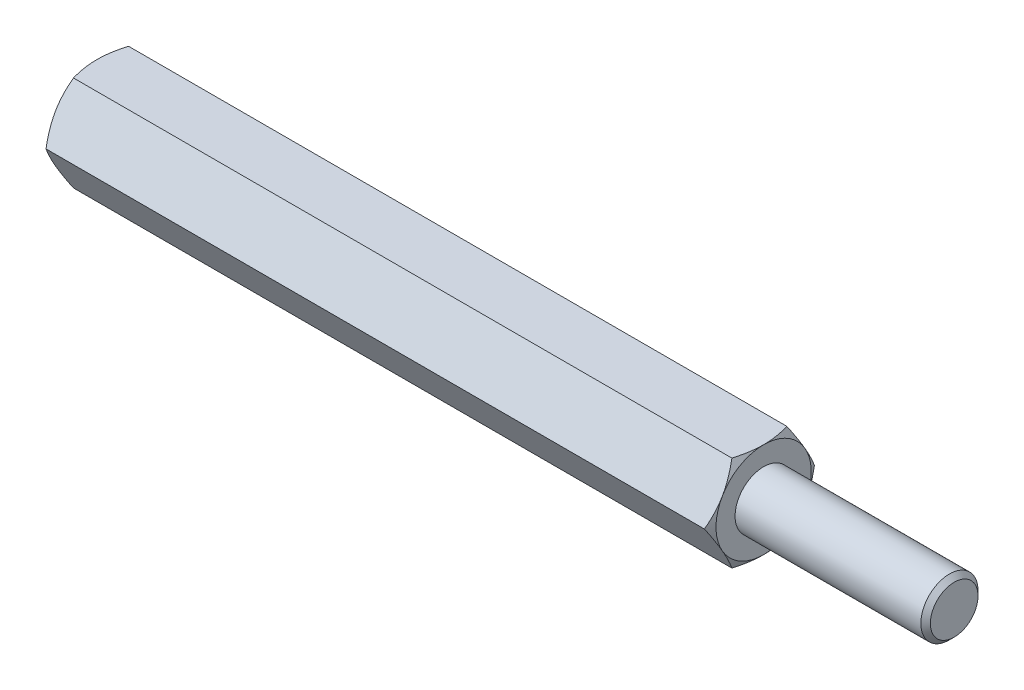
ISO-10303-21;
HEADER;
FILE_DESCRIPTION(('STEP AP214'),'2;1');
FILE_NAME('part.step','',(''),(''),'','','');
FILE_SCHEMA(('AUTOMOTIVE_DESIGN { 1 0 10303 214 1 1 1 1 }'));
ENDSEC;
DATA;
#1=APPLICATION_CONTEXT('core data for automotive mechanical design processes');
#2=APPLICATION_PROTOCOL_DEFINITION('international standard','automotive_design',2000,#1);
#3=PRODUCT_CONTEXT('',#1,'mechanical');
#4=PRODUCT('Part','Part','',(#3));
#5=PRODUCT_RELATED_PRODUCT_CATEGORY('part','',(#4));
#6=PRODUCT_DEFINITION_FORMATION('','',#4);
#7=PRODUCT_DEFINITION_CONTEXT('part definition',#1,'design');
#8=PRODUCT_DEFINITION('design','',#6,#7);
#9=PRODUCT_DEFINITION_SHAPE('','',#8);
#10=(LENGTH_UNIT() NAMED_UNIT(*) SI_UNIT(.MILLI.,.METRE.));
#11=(NAMED_UNIT(*) PLANE_ANGLE_UNIT() SI_UNIT($,.RADIAN.));
#12=(NAMED_UNIT(*) SI_UNIT($,.STERADIAN.) SOLID_ANGLE_UNIT());
#13=UNCERTAINTY_MEASURE_WITH_UNIT(LENGTH_MEASURE(1.E-05),#10,'distance_accuracy_value','');
#14=(GEOMETRIC_REPRESENTATION_CONTEXT(3) GLOBAL_UNCERTAINTY_ASSIGNED_CONTEXT((#13)) GLOBAL_UNIT_ASSIGNED_CONTEXT((#10,
#11,#12)) REPRESENTATION_CONTEXT('',''));
#15=CARTESIAN_POINT('',(0.,0.,0.));
#16=DIRECTION('',(0.,0.,1.));
#17=DIRECTION('',(1.,0.,0.));
#18=AXIS2_PLACEMENT_3D('',#15,#16,#17);
#19=CARTESIAN_POINT('',(17.5,2.5,-1.44337567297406));
#20=DIRECTION('',(1.,0.,0.));
#21=DIRECTION('',(0.,0.,-1.));
#22=AXIS2_PLACEMENT_3D('',#19,#20,#21);
#23=PLANE('',#22);
#24=CARTESIAN_POINT('',(17.5,0.,0.));
#25=DIRECTION('',(1.,0.,0.));
#26=DIRECTION('',(0.,0.,-1.));
#27=AXIS2_PLACEMENT_3D('',#24,#25,#26);
#28=CIRCLE('',#27,2.5);
#29=CARTESIAN_POINT('',(17.5,-1.25,-2.1650635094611));
#30=VERTEX_POINT('',#29);
#31=CARTESIAN_POINT('',(17.5,1.25,-2.1650635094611));
#32=VERTEX_POINT('',#31);
#33=EDGE_CURVE('E288',#30,#32,#28,.T.);
#34=ORIENTED_EDGE('',*,*,#33,.T.);
#35=CARTESIAN_POINT('',(17.5,2.5,0.));
#36=VERTEX_POINT('',#35);
#37=EDGE_CURVE('E53',#32,#36,#28,.T.);
#38=ORIENTED_EDGE('',*,*,#37,.T.);
#39=CARTESIAN_POINT('',(17.5,1.25,2.1650635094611));
#40=VERTEX_POINT('',#39);
#41=EDGE_CURVE('E297',#36,#40,#28,.T.);
#42=ORIENTED_EDGE('',*,*,#41,.T.);
#43=CARTESIAN_POINT('',(17.5,-1.25000000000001,2.1650635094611));
#44=VERTEX_POINT('',#43);
#45=EDGE_CURVE('E302',#40,#44,#28,.T.);
#46=ORIENTED_EDGE('',*,*,#45,.T.);
#47=CARTESIAN_POINT('',(17.5,0.,0.));
#48=DIRECTION('',(-1.,0.,0.));
#49=DIRECTION('',(0.,-1.,0.));
#50=AXIS2_PLACEMENT_3D('',#47,#48,#49);
#51=CIRCLE('',#50,2.5);
#52=CARTESIAN_POINT('',(17.5,-2.50000000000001,0.));
#53=VERTEX_POINT('',#52);
#54=EDGE_CURVE('E193',#53,#44,#51,.T.);
#55=ORIENTED_EDGE('',*,*,#54,.F.);
#56=EDGE_CURVE('E61',#53,#30,#28,.T.);
#57=ORIENTED_EDGE('',*,*,#56,.T.);
#58=EDGE_LOOP('',(#34,#38,#42,#46,#55,#57));
#59=FACE_BOUND('',#58,.T.);
#60=CARTESIAN_POINT('',(17.5,0.,0.));
#61=DIRECTION('',(1.,0.,0.));
#62=DIRECTION('',(0.,0.,-1.));
#63=AXIS2_PLACEMENT_3D('',#60,#61,#62);
#64=CIRCLE('',#63,1.5);
#65=CARTESIAN_POINT('',(17.5,0.,-1.5));
#66=VERTEX_POINT('',#65);
#67=EDGE_CURVE('E324',#66,#66,#64,.T.);
#68=ORIENTED_EDGE('',*,*,#67,.F.);
#69=EDGE_LOOP('',(#68));
#70=FACE_BOUND('',#69,.T.);
#71=ADVANCED_FACE('F37',(#59,#70),#23,.T.);
#72=CARTESIAN_POINT('',(17.5,0.,-2.88675134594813));
#73=DIRECTION('',(0.,-0.5,0.866025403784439));
#74=DIRECTION('',(0.,-0.866025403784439,-0.5));
#75=AXIS2_PLACEMENT_3D('',#72,#73,#74);
#76=PLANE('',#75);
#77=CARTESIAN_POINT('',(17.2766423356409,-0.000199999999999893,-2.88686681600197));
#78=CARTESIAN_POINT('',(17.3132783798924,0.109663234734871,-2.82343724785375));
#79=CARTESIAN_POINT('',(17.346597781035,0.220474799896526,-2.75946016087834));
#80=CARTESIAN_POINT('',(17.4047577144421,0.44401683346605,-2.63039810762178));
#81=CARTESIAN_POINT('',(17.4295776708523,0.556751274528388,-2.5653108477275));
#82=CARTESIAN_POINT('',(17.468214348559,0.780822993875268,-2.43594298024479));
#83=CARTESIAN_POINT('',(17.4822882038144,0.892125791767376,-2.37168227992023));
#84=CARTESIAN_POINT('',(17.4990908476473,1.11525522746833,-2.24285844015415));
#85=CARTESIAN_POINT('',(17.5018335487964,1.22708105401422,-2.17829576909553));
#86=CARTESIAN_POINT('',(17.4961342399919,1.43604197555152,-2.05765212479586));
#87=CARTESIAN_POINT('',(17.4890916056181,1.53320831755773,-2.0015531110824));
#88=CARTESIAN_POINT('',(17.4667685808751,1.726907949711,-1.88972057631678));
#89=CARTESIAN_POINT('',(17.4514805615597,1.82344056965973,-1.8339874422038));
#90=CARTESIAN_POINT('',(17.4132609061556,2.01753972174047,-1.7219242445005));
#91=CARTESIAN_POINT('',(17.3901672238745,2.11508168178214,-1.66560836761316));
#92=CARTESIAN_POINT('',(17.3377533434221,2.30871060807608,-1.55381665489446));
#93=CARTESIAN_POINT('',(17.3084454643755,2.40480005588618,-1.49833938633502));
#94=CARTESIAN_POINT('',(17.2766423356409,2.5002,-1.44326020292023));
#95=B_SPLINE_CURVE_WITH_KNOTS('',3,(#77,#78,#79,#80,#81,#82,#83,#84,#85,#86,#87,#88,#89,#90,#91,
#92,#93,#94),.UNSPECIFIED.,.F.,.F.,(4,2,2,2,2,2,2,2,4),(0.,0.396285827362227,0.79352433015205,
1.18093086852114,1.56786160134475,1.90479741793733,2.24204551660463,2.58677531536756,
2.93082800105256),.UNSPECIFIED.);
#96=CARTESIAN_POINT('',(17.2767090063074,0.,-2.88675134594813));
#97=VERTEX_POINT('',#96);
#98=EDGE_CURVE('E489',#97,#32,#95,.T.);
#99=ORIENTED_EDGE('',*,*,#98,.F.);
#100=DIRECTION('',(-1.,0.,0.));
#101=VECTOR('',#100,1.);
#102=CARTESIAN_POINT('',(17.5,0.,-2.88675134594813));
#103=LINE('',#102,#101);
#104=CARTESIAN_POINT('',(-17.2767090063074,0.,-2.88675134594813));
#105=VERTEX_POINT('',#104);
#106=EDGE_CURVE('E264',#97,#105,#103,.T.);
#107=ORIENTED_EDGE('',*,*,#106,.T.);
#108=CARTESIAN_POINT('',(-17.2766423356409,2.5002,-1.44326020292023));
#109=CARTESIAN_POINT('',(-17.3132783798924,2.39033676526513,-1.50668977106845));
#110=CARTESIAN_POINT('',(-17.346597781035,2.27952520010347,-1.57066685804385));
#111=CARTESIAN_POINT('',(-17.4047577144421,2.05598316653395,-1.69972891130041));
#112=CARTESIAN_POINT('',(-17.4295776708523,1.94324872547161,-1.7648161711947));
#113=CARTESIAN_POINT('',(-17.468214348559,1.71917700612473,-1.8941840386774));
#114=CARTESIAN_POINT('',(-17.4822882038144,1.60787420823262,-1.95844473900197));
#115=CARTESIAN_POINT('',(-17.4990908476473,1.38474477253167,-2.08726857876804));
#116=CARTESIAN_POINT('',(-17.5018335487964,1.27291894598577,-2.15183124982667));
#117=CARTESIAN_POINT('',(-17.4961342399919,1.06395802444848,-2.27247489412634));
#118=CARTESIAN_POINT('',(-17.4890916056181,0.966791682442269,-2.32857390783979));
#119=CARTESIAN_POINT('',(-17.4667685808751,0.773092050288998,-2.44040644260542));
#120=CARTESIAN_POINT('',(-17.4514805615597,0.676559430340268,-2.49613957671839));
#121=CARTESIAN_POINT('',(-17.4132609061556,0.482460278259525,-2.60820277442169));
#122=CARTESIAN_POINT('',(-17.3901672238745,0.38491831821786,-2.66451865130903));
#123=CARTESIAN_POINT('',(-17.3377533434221,0.191289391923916,-2.77631036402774));
#124=CARTESIAN_POINT('',(-17.3084454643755,0.0951999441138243,-2.83178763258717));
#125=CARTESIAN_POINT('',(-17.2766423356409,-0.000200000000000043,-2.88686681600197));
#126=B_SPLINE_CURVE_WITH_KNOTS('',3,(#108,#109,#110,#111,#112,#113,#114,#115,#116,#117,#118,
#119,#120,#121,#122,#123,#124,#125),.UNSPECIFIED.,.F.,.F.,(4,2,2,2,2,2,2,2,4),(0.,
0.396285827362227,0.793524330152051,1.18093086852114,1.56786160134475,1.90479741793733,
2.24204551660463,2.58677531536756,2.93082800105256),.UNSPECIFIED.);
#127=CARTESIAN_POINT('',(-17.5,1.25,-2.1650635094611));
#128=VERTEX_POINT('',#127);
#129=EDGE_CURVE('E507',#128,#105,#126,.T.);
#130=ORIENTED_EDGE('',*,*,#129,.F.);
#131=CARTESIAN_POINT('',(-17.2767090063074,2.5,-1.44337567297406));
#132=VERTEX_POINT('',#131);
#133=EDGE_CURVE('E505',#132,#128,#126,.T.);
#134=ORIENTED_EDGE('',*,*,#133,.F.);
#135=DIRECTION('',(-1.,0.,0.));
#136=VECTOR('',#135,1.);
#137=CARTESIAN_POINT('',(17.5,2.5,-1.44337567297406));
#138=LINE('',#137,#136);
#139=CARTESIAN_POINT('',(17.2767090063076,2.5,-1.44337567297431));
#140=VERTEX_POINT('',#139);
#141=EDGE_CURVE('E279',#140,#132,#138,.T.);
#142=ORIENTED_EDGE('',*,*,#141,.F.);
#143=EDGE_CURVE('E229',#32,#140,#95,.T.);
#144=ORIENTED_EDGE('',*,*,#143,.F.);
#145=EDGE_LOOP('',(#99,#107,#130,#134,#142,#144));
#146=FACE_BOUND('',#145,.T.);
#147=ADVANCED_FACE('F148',(#146),#76,.F.);
#148=CARTESIAN_POINT('',(17.5,2.5,-1.44337567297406));
#149=DIRECTION('',(0.,-1.,0.));
#150=DIRECTION('',(0.,0.,-1.));
#151=AXIS2_PLACEMENT_3D('',#148,#149,#150);
#152=PLANE('',#151);
#153=CARTESIAN_POINT('',(16.2680338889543,2.5,-3.90158441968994));
#154=CARTESIAN_POINT('',(16.3212077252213,2.5,-3.79217004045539));
#155=CARTESIAN_POINT('',(16.3738786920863,2.5,-3.68250707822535));
#156=CARTESIAN_POINT('',(16.4779324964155,2.5,-3.46255185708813));
#157=CARTESIAN_POINT('',(16.5293151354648,2.5,-3.35225950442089));
#158=CARTESIAN_POINT('',(16.6307630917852,2.5,-3.13035696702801));
#159=CARTESIAN_POINT('',(16.6808199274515,2.5,-3.0187428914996));
#160=CARTESIAN_POINT('',(16.7789171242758,2.5,-2.79463535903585));
#161=CARTESIAN_POINT('',(16.8269575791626,2.5,-2.68214194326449));
#162=CARTESIAN_POINT('',(16.9220184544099,2.5,-2.45240385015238));
#163=CARTESIAN_POINT('',(16.9689543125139,2.5,-2.33512399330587));
#164=CARTESIAN_POINT('',(17.0593326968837,2.5,-2.09920133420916));
#165=CARTESIAN_POINT('',(17.1027748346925,2.5,-1.98055838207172));
#166=CARTESIAN_POINT('',(17.1850435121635,2.5,-1.74193489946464));
#167=CARTESIAN_POINT('',(17.2238791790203,2.5,-1.6219575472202));
#168=CARTESIAN_POINT('',(17.2957050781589,2.5,-1.38028205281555));
#169=CARTESIAN_POINT('',(17.3286971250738,2.5,-1.25858445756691));
#170=CARTESIAN_POINT('',(17.3870959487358,2.5,-1.01406369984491));
#171=CARTESIAN_POINT('',(17.4125437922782,2.5,-0.891250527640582));
#172=CARTESIAN_POINT('',(17.4544275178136,2.5,-0.64407172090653));
#173=CARTESIAN_POINT('',(17.4708643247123,2.5,-0.519706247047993));
#174=CARTESIAN_POINT('',(17.4932006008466,2.5,-0.271679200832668));
#175=CARTESIAN_POINT('',(17.4992375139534,2.5,-0.148030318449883));
#176=CARTESIAN_POINT('',(17.5006256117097,2.5,0.0993395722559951));
#177=CARTESIAN_POINT('',(17.4959765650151,2.5,0.223060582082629));
#178=CARTESIAN_POINT('',(17.4794044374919,2.5,0.432351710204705));
#179=CARTESIAN_POINT('',(17.4701066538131,2.5,0.518143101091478));
#180=CARTESIAN_POINT('',(17.4469384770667,2.5,0.689112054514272));
#181=CARTESIAN_POINT('',(17.4330674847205,2.5,0.774289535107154));
#182=CARTESIAN_POINT('',(17.3853202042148,2.5,1.02876599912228));
#183=CARTESIAN_POINT('',(17.3453176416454,2.5,1.19691958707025));
#184=CARTESIAN_POINT('',(17.2522656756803,2.5,1.53362893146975));
#185=CARTESIAN_POINT('',(17.1989362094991,2.5,1.70210423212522));
#186=CARTESIAN_POINT('',(17.1123716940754,2.5,1.95247339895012));
#187=CARTESIAN_POINT('',(17.0824247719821,2.5,2.0355318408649));
#188=CARTESIAN_POINT('',(17.0206840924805,2.5,2.20095860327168));
#189=CARTESIAN_POINT('',(16.9888903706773,2.5,2.28332693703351));
#190=CARTESIAN_POINT('',(16.904014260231,2.5,2.49723312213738));
#191=CARTESIAN_POINT('',(16.8497173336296,2.5,2.62828796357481));
#192=CARTESIAN_POINT('',(16.7381273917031,2.5,2.88912034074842));
#193=CARTESIAN_POINT('',(16.6808341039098,2.5,3.01889775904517));
#194=CARTESIAN_POINT('',(16.5639348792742,2.5,3.27745045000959));
#195=CARTESIAN_POINT('',(16.504328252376,2.5,3.40622540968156));
#196=CARTESIAN_POINT('',(16.3833234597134,2.5,3.66293235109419));
#197=CARTESIAN_POINT('',(16.321925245,2.5,3.7908643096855));
#198=CARTESIAN_POINT('',(16.1354580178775,2.5,4.17399495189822));
#199=CARTESIAN_POINT('',(16.0082824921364,2.5,4.42816724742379));
#200=CARTESIAN_POINT('',(15.7503455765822,2.5,4.9346146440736));
#201=CARTESIAN_POINT('',(15.6195848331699,2.5,5.1868900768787));
#202=CARTESIAN_POINT('',(15.3687100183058,2.5,5.66512451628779));
#203=CARTESIAN_POINT('',(15.2488298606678,2.5,5.89120644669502));
#204=CARTESIAN_POINT('',(15.0075902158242,2.5,6.34259369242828));
#205=CARTESIAN_POINT('',(14.8862306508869,2.5,6.56789896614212));
#206=CARTESIAN_POINT('',(14.642780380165,2.5,7.01722044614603));
#207=CARTESIAN_POINT('',(14.5206930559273,2.5,7.24123848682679));
#208=CARTESIAN_POINT('',(14.2756662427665,2.5,7.68878772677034));
#209=CARTESIAN_POINT('',(14.152726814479,2.5,7.91231895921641));
#210=CARTESIAN_POINT('',(14.0294756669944,2.5,8.1356769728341));
#211=B_SPLINE_CURVE_WITH_KNOTS('',3,(#153,#154,#155,#156,#157,#158,#159,#160,#161,#162,#163,
#164,#165,#166,#167,#168,#169,#170,#171,#172,#173,#174,#175,#176,#177,#178,#179,#180,#181,#182,
#183,#184,#185,#186,#187,#188,#189,#190,#191,#192,#193,#194,#195,#196,#197,#198,#199,#200,#201,
#202,#203,#204,#205,#206,#207,#208,#209,#210),.UNSPECIFIED.,.F.,.F.,(4,2,2,2,2,2,2,2,2,2,2,2,2,
2,2,2,2,2,2,2,2,2,2,2,2,2,2,2,4),(0.,0.364957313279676,0.729970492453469,1.09692930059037,
1.46387103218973,1.84279746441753,2.22176597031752,2.59997058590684,2.97805755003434,
3.3540469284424,3.72999770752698,4.10094071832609,4.47189175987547,4.73064905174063,
4.98944026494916,5.50729076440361,6.037104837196,6.30196454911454,6.56681915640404,
6.99233818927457,7.41789598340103,7.84358170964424,8.26927907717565,9.12186602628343,
9.97430025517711,10.7419897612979,11.5097197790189,12.2750964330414,13.0404191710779),.UNSPECIFIED.);
#212=EDGE_CURVE('E227',#140,#36,#211,.T.);
#213=ORIENTED_EDGE('',*,*,#212,.F.);
#214=ORIENTED_EDGE('',*,*,#141,.T.);
#215=CARTESIAN_POINT('',(-16.2680338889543,2.5,-3.90158441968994));
#216=CARTESIAN_POINT('',(-16.3212077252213,2.5,-3.79217004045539));
#217=CARTESIAN_POINT('',(-16.3738786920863,2.5,-3.68250707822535));
#218=CARTESIAN_POINT('',(-16.4779324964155,2.5,-3.46255185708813));
#219=CARTESIAN_POINT('',(-16.5293151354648,2.5,-3.35225950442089));
#220=CARTESIAN_POINT('',(-16.6307630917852,2.5,-3.13035696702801));
#221=CARTESIAN_POINT('',(-16.6808199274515,2.5,-3.0187428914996));
#222=CARTESIAN_POINT('',(-16.7789171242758,2.5,-2.79463535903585));
#223=CARTESIAN_POINT('',(-16.8269575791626,2.5,-2.68214194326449));
#224=CARTESIAN_POINT('',(-16.9220184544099,2.5,-2.45240385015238));
#225=CARTESIAN_POINT('',(-16.9689543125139,2.5,-2.33512399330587));
#226=CARTESIAN_POINT('',(-17.0593326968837,2.5,-2.09920133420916));
#227=CARTESIAN_POINT('',(-17.1027748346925,2.5,-1.98055838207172));
#228=CARTESIAN_POINT('',(-17.1850435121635,2.5,-1.74193489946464));
#229=CARTESIAN_POINT('',(-17.2238791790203,2.5,-1.6219575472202));
#230=CARTESIAN_POINT('',(-17.2957050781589,2.5,-1.38028205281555));
#231=CARTESIAN_POINT('',(-17.3286971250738,2.5,-1.25858445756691));
#232=CARTESIAN_POINT('',(-17.3870959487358,2.5,-1.01406369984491));
#233=CARTESIAN_POINT('',(-17.4125437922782,2.5,-0.891250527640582));
#234=CARTESIAN_POINT('',(-17.4544275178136,2.5,-0.64407172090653));
#235=CARTESIAN_POINT('',(-17.4708643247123,2.5,-0.519706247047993));
#236=CARTESIAN_POINT('',(-17.4932006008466,2.5,-0.271679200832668));
#237=CARTESIAN_POINT('',(-17.4992375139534,2.5,-0.148030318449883));
#238=CARTESIAN_POINT('',(-17.5006256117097,2.5,0.0993395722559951));
#239=CARTESIAN_POINT('',(-17.4959765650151,2.5,0.223060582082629));
#240=CARTESIAN_POINT('',(-17.4794044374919,2.5,0.432351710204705));
#241=CARTESIAN_POINT('',(-17.4701066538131,2.5,0.518143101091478));
#242=CARTESIAN_POINT('',(-17.4469384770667,2.5,0.689112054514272));
#243=CARTESIAN_POINT('',(-17.4330674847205,2.5,0.774289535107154));
#244=CARTESIAN_POINT('',(-17.3853202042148,2.5,1.02876599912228));
#245=CARTESIAN_POINT('',(-17.3453176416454,2.5,1.19691958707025));
#246=CARTESIAN_POINT('',(-17.2522656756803,2.5,1.53362893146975));
#247=CARTESIAN_POINT('',(-17.1989362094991,2.5,1.70210423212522));
#248=CARTESIAN_POINT('',(-17.1123716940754,2.5,1.95247339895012));
#249=CARTESIAN_POINT('',(-17.0824247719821,2.5,2.0355318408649));
#250=CARTESIAN_POINT('',(-17.0206840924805,2.5,2.20095860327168));
#251=CARTESIAN_POINT('',(-16.9888903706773,2.5,2.28332693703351));
#252=CARTESIAN_POINT('',(-16.904014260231,2.5,2.49723312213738));
#253=CARTESIAN_POINT('',(-16.8497173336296,2.5,2.62828796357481));
#254=CARTESIAN_POINT('',(-16.7381273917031,2.5,2.88912034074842));
#255=CARTESIAN_POINT('',(-16.6808341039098,2.5,3.01889775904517));
#256=CARTESIAN_POINT('',(-16.5639348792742,2.5,3.27745045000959));
#257=CARTESIAN_POINT('',(-16.504328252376,2.5,3.40622540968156));
#258=CARTESIAN_POINT('',(-16.3833234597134,2.5,3.66293235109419));
#259=CARTESIAN_POINT('',(-16.321925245,2.5,3.7908643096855));
#260=CARTESIAN_POINT('',(-16.1354580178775,2.5,4.17399495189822));
#261=CARTESIAN_POINT('',(-16.0082824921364,2.5,4.42816724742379));
#262=CARTESIAN_POINT('',(-15.7503455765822,2.5,4.9346146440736));
#263=CARTESIAN_POINT('',(-15.6195848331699,2.5,5.1868900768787));
#264=CARTESIAN_POINT('',(-15.3687100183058,2.5,5.66512451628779));
#265=CARTESIAN_POINT('',(-15.2488298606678,2.5,5.89120644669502));
#266=CARTESIAN_POINT('',(-15.0075902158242,2.5,6.34259369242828));
#267=CARTESIAN_POINT('',(-14.8862306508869,2.5,6.56789896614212));
#268=CARTESIAN_POINT('',(-14.642780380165,2.5,7.01722044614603));
#269=CARTESIAN_POINT('',(-14.5206930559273,2.5,7.24123848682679));
#270=CARTESIAN_POINT('',(-14.2756662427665,2.5,7.68878772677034));
#271=CARTESIAN_POINT('',(-14.152726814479,2.5,7.91231895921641));
#272=CARTESIAN_POINT('',(-14.0294756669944,2.5,8.1356769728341));
#273=B_SPLINE_CURVE_WITH_KNOTS('',3,(#215,#216,#217,#218,#219,#220,#221,#222,#223,#224,#225,
#226,#227,#228,#229,#230,#231,#232,#233,#234,#235,#236,#237,#238,#239,#240,#241,#242,#243,#244,
#245,#246,#247,#248,#249,#250,#251,#252,#253,#254,#255,#256,#257,#258,#259,#260,#261,#262,#263,
#264,#265,#266,#267,#268,#269,#270,#271,#272),.UNSPECIFIED.,.F.,.F.,(4,2,2,2,2,2,2,2,2,2,2,2,2,
2,2,2,2,2,2,2,2,2,2,2,2,2,2,2,4),(0.,0.364957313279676,0.729970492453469,1.09692930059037,
1.46387103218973,1.84279746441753,2.22176597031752,2.59997058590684,2.97805755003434,
3.3540469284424,3.72999770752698,4.10094071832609,4.47189175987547,4.73064905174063,
4.98944026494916,5.50729076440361,6.037104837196,6.30196454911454,6.56681915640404,
6.99233818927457,7.41789598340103,7.84358170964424,8.26927907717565,9.12186602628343,
9.97430025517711,10.7419897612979,11.5097197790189,12.2750964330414,13.0404191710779),.UNSPECIFIED.);
#274=CARTESIAN_POINT('',(-17.5,2.5,0.));
#275=VERTEX_POINT('',#274);
#276=EDGE_CURVE('E241',#275,#132,#273,.F.);
#277=ORIENTED_EDGE('',*,*,#276,.F.);
#278=CARTESIAN_POINT('',(-17.2767090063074,2.5,1.44337567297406));
#279=VERTEX_POINT('',#278);
#280=EDGE_CURVE('E249',#279,#275,#273,.F.);
#281=ORIENTED_EDGE('',*,*,#280,.F.);
#282=DIRECTION('',(-1.,0.,0.));
#283=VECTOR('',#282,1.);
#284=CARTESIAN_POINT('',(17.5,2.5,1.44337567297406));
#285=LINE('',#284,#283);
#286=CARTESIAN_POINT('',(17.2767090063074,2.5,1.44337567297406));
#287=VERTEX_POINT('',#286);
#288=EDGE_CURVE('E276',#287,#279,#285,.T.);
#289=ORIENTED_EDGE('',*,*,#288,.F.);
#290=EDGE_CURVE('E221',#36,#287,#211,.T.);
#291=ORIENTED_EDGE('',*,*,#290,.F.);
#292=EDGE_LOOP('',(#213,#214,#277,#281,#289,#291));
#293=FACE_BOUND('',#292,.T.);
#294=ADVANCED_FACE('F153',(#293),#152,.F.);
#295=CARTESIAN_POINT('',(17.5,2.5,1.44337567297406));
#296=DIRECTION('',(0.,-0.5,-0.866025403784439));
#297=DIRECTION('',(0.,0.866025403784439,-0.5));
#298=AXIS2_PLACEMENT_3D('',#295,#296,#297);
#299=PLANE('',#298);
#300=CARTESIAN_POINT('',(17.2766423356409,2.5002,1.44326020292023));
#301=CARTESIAN_POINT('',(17.3132783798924,2.39033676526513,1.50668977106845));
#302=CARTESIAN_POINT('',(17.3465977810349,2.27952520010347,1.57066685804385));
#303=CARTESIAN_POINT('',(17.4047577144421,2.05598316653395,1.69972891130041));
#304=CARTESIAN_POINT('',(17.4295776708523,1.94324872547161,1.7648161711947));
#305=CARTESIAN_POINT('',(17.468214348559,1.71917700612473,1.8941840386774));
#306=CARTESIAN_POINT('',(17.4822882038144,1.60787420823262,1.95844473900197));
#307=CARTESIAN_POINT('',(17.4990908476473,1.38474477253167,2.08726857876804));
#308=CARTESIAN_POINT('',(17.5018335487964,1.27291894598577,2.15183124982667));
#309=CARTESIAN_POINT('',(17.4961342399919,1.06395802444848,2.27247489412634));
#310=CARTESIAN_POINT('',(17.4890916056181,0.96679168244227,2.32857390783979));
#311=CARTESIAN_POINT('',(17.4667685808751,0.773092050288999,2.44040644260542));
#312=CARTESIAN_POINT('',(17.4514805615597,0.676559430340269,2.49613957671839));
#313=CARTESIAN_POINT('',(17.4132609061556,0.482460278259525,2.60820277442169));
#314=CARTESIAN_POINT('',(17.3901672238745,0.384918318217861,2.66451865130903));
#315=CARTESIAN_POINT('',(17.3377533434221,0.191289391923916,2.77631036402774));
#316=CARTESIAN_POINT('',(17.3084454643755,0.0951999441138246,2.83178763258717));
#317=CARTESIAN_POINT('',(17.2766423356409,-0.000199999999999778,2.88686681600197));
#318=B_SPLINE_CURVE_WITH_KNOTS('',3,(#300,#301,#302,#303,#304,#305,#306,#307,#308,#309,#310,
#311,#312,#313,#314,#315,#316,#317),.UNSPECIFIED.,.F.,.F.,(4,2,2,2,2,2,2,2,4),(0.,
0.396285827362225,0.793524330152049,1.18093086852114,1.56786160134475,1.90479741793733,
2.24204551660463,2.58677531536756,2.93082800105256),.UNSPECIFIED.);
#319=EDGE_CURVE('E228',#287,#40,#318,.T.);
#320=ORIENTED_EDGE('',*,*,#319,.F.);
#321=ORIENTED_EDGE('',*,*,#288,.T.);
#322=CARTESIAN_POINT('',(-17.2766423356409,-0.000199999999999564,2.88686681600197));
#323=CARTESIAN_POINT('',(-17.3132783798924,0.109663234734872,2.82343724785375));
#324=CARTESIAN_POINT('',(-17.346597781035,0.220474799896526,2.75946016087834));
#325=CARTESIAN_POINT('',(-17.4047577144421,0.44401683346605,2.63039810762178));
#326=CARTESIAN_POINT('',(-17.4295776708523,0.556751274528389,2.5653108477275));
#327=CARTESIAN_POINT('',(-17.468214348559,0.780822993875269,2.43594298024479));
#328=CARTESIAN_POINT('',(-17.4822882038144,0.892125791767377,2.37168227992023));
#329=CARTESIAN_POINT('',(-17.4990908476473,1.11525522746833,2.24285844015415));
#330=CARTESIAN_POINT('',(-17.5018335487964,1.22708105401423,2.17829576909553));
#331=CARTESIAN_POINT('',(-17.4961342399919,1.43604197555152,2.05765212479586));
#332=CARTESIAN_POINT('',(-17.4890916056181,1.53320831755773,2.0015531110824));
#333=CARTESIAN_POINT('',(-17.4667685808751,1.726907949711,1.88972057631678));
#334=CARTESIAN_POINT('',(-17.4514805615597,1.82344056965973,1.8339874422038));
#335=CARTESIAN_POINT('',(-17.4132609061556,2.01753972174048,1.7219242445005));
#336=CARTESIAN_POINT('',(-17.3901672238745,2.11508168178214,1.66560836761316));
#337=CARTESIAN_POINT('',(-17.3377533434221,2.30871060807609,1.55381665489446));
#338=CARTESIAN_POINT('',(-17.3084454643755,2.40480005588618,1.49833938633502));
#339=CARTESIAN_POINT('',(-17.2766423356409,2.5002,1.44326020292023));
#340=B_SPLINE_CURVE_WITH_KNOTS('',3,(#322,#323,#324,#325,#326,#327,#328,#329,#330,#331,#332,
#333,#334,#335,#336,#337,#338,#339),.UNSPECIFIED.,.F.,.F.,(4,2,2,2,2,2,2,2,4),(0.,
0.396285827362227,0.793524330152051,1.18093086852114,1.56786160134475,1.90479741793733,
2.24204551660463,2.58677531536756,2.93082800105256),.UNSPECIFIED.);
#341=CARTESIAN_POINT('',(-17.5,1.25,2.1650635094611));
#342=VERTEX_POINT('',#341);
#343=EDGE_CURVE('E255',#342,#279,#340,.T.);
#344=ORIENTED_EDGE('',*,*,#343,.F.);
#345=CARTESIAN_POINT('',(-17.2767090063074,0.,2.88675134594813));
#346=VERTEX_POINT('',#345);
#347=EDGE_CURVE('E262',#346,#342,#340,.T.);
#348=ORIENTED_EDGE('',*,*,#347,.F.);
#349=DIRECTION('',(-1.,0.,0.));
#350=VECTOR('',#349,1.);
#351=CARTESIAN_POINT('',(17.5,0.,2.88675134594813));
#352=LINE('',#351,#350);
#353=CARTESIAN_POINT('',(17.2767090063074,0.,2.88675134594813));
#354=VERTEX_POINT('',#353);
#355=EDGE_CURVE('E273',#354,#346,#352,.T.);
#356=ORIENTED_EDGE('',*,*,#355,.F.);
#357=EDGE_CURVE('E215',#40,#354,#318,.T.);
#358=ORIENTED_EDGE('',*,*,#357,.F.);
#359=EDGE_LOOP('',(#320,#321,#344,#348,#356,#358));
#360=FACE_BOUND('',#359,.T.);
#361=ADVANCED_FACE('F235',(#360),#299,.F.);
#362=CARTESIAN_POINT('',(17.5,0.,2.88675134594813));
#363=DIRECTION('',(0.,0.5,-0.866025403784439));
#364=DIRECTION('',(0.,0.866025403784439,0.5));
#365=AXIS2_PLACEMENT_3D('',#362,#363,#364);
#366=PLANE('',#365);
#367=CARTESIAN_POINT('',(17.2766423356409,0.000200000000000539,2.88686681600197));
#368=CARTESIAN_POINT('',(17.3132783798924,-0.109663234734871,2.82343724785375));
#369=CARTESIAN_POINT('',(17.346597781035,-0.220474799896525,2.75946016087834));
#370=CARTESIAN_POINT('',(17.4047577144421,-0.444016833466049,2.63039810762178));
#371=CARTESIAN_POINT('',(17.4295776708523,-0.556751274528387,2.5653108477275));
#372=CARTESIAN_POINT('',(17.468214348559,-0.780822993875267,2.43594298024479));
#373=CARTESIAN_POINT('',(17.4822882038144,-0.892125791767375,2.37168227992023));
#374=CARTESIAN_POINT('',(17.4990908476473,-1.11525522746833,2.24285844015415));
#375=CARTESIAN_POINT('',(17.5018335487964,-1.22708105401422,2.17829576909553));
#376=CARTESIAN_POINT('',(17.4961342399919,-1.43604197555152,2.05765212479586));
#377=CARTESIAN_POINT('',(17.4890916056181,-1.53320831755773,2.0015531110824));
#378=CARTESIAN_POINT('',(17.4667685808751,-1.726907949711,1.88972057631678));
#379=CARTESIAN_POINT('',(17.4514805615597,-1.82344056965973,1.8339874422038));
#380=CARTESIAN_POINT('',(17.4132609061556,-2.01753972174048,1.7219242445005));
#381=CARTESIAN_POINT('',(17.3901672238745,-2.11508168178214,1.66560836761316));
#382=CARTESIAN_POINT('',(17.3377533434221,-2.30871060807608,1.55381665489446));
#383=CARTESIAN_POINT('',(17.3084454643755,-2.40480005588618,1.49833938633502));
#384=CARTESIAN_POINT('',(17.2766423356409,-2.5002,1.44326020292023));
#385=B_SPLINE_CURVE_WITH_KNOTS('',3,(#367,#368,#369,#370,#371,#372,#373,#374,#375,#376,#377,
#378,#379,#380,#381,#382,#383,#384),.UNSPECIFIED.,.F.,.F.,(4,2,2,2,2,2,2,2,4),(0.,
0.396285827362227,0.793524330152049,1.18093086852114,1.56786160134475,1.90479741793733,
2.24204551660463,2.58677531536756,2.93082800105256),.UNSPECIFIED.);
#386=EDGE_CURVE('E341',#354,#44,#385,.T.);
#387=ORIENTED_EDGE('',*,*,#386,.F.);
#388=ORIENTED_EDGE('',*,*,#355,.T.);
#389=CARTESIAN_POINT('',(-17.2766423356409,-2.5002,1.44326020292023));
#390=CARTESIAN_POINT('',(-17.3132783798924,-2.39033676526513,1.50668977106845));
#391=CARTESIAN_POINT('',(-17.346597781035,-2.27952520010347,1.57066685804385));
#392=CARTESIAN_POINT('',(-17.4047577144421,-2.05598316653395,1.69972891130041));
#393=CARTESIAN_POINT('',(-17.4295776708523,-1.94324872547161,1.7648161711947));
#394=CARTESIAN_POINT('',(-17.468214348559,-1.71917700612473,1.8941840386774));
#395=CARTESIAN_POINT('',(-17.4822882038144,-1.60787420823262,1.95844473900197));
#396=CARTESIAN_POINT('',(-17.4990908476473,-1.38474477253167,2.08726857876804));
#397=CARTESIAN_POINT('',(-17.5018335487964,-1.27291894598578,2.15183124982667));
#398=CARTESIAN_POINT('',(-17.4961342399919,-1.06395802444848,2.27247489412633));
#399=CARTESIAN_POINT('',(-17.4890916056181,-0.966791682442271,2.32857390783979));
#400=CARTESIAN_POINT('',(-17.4667685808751,-0.773092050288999,2.44040644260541));
#401=CARTESIAN_POINT('',(-17.4514805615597,-0.676559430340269,2.49613957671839));
#402=CARTESIAN_POINT('',(-17.4132609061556,-0.482460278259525,2.60820277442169));
#403=CARTESIAN_POINT('',(-17.3901672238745,-0.384918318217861,2.66451865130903));
#404=CARTESIAN_POINT('',(-17.3377533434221,-0.191289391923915,2.77631036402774));
#405=CARTESIAN_POINT('',(-17.3084454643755,-0.0951999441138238,2.83178763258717));
#406=CARTESIAN_POINT('',(-17.2766423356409,0.00020000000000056,2.88686681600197));
#407=B_SPLINE_CURVE_WITH_KNOTS('',3,(#389,#390,#391,#392,#393,#394,#395,#396,#397,#398,#399,
#400,#401,#402,#403,#404,#405,#406),.UNSPECIFIED.,.F.,.F.,(4,2,2,2,2,2,2,2,4),(0.,
0.396285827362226,0.793524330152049,1.18093086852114,1.56786160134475,1.90479741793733,
2.24204551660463,2.58677531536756,2.93082800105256),.UNSPECIFIED.);
#408=CARTESIAN_POINT('',(-17.5,-1.25000000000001,2.1650635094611));
#409=VERTEX_POINT('',#408);
#410=EDGE_CURVE('E263',#409,#346,#407,.T.);
#411=ORIENTED_EDGE('',*,*,#410,.F.);
#412=CARTESIAN_POINT('',(-17.2767090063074,-2.5,1.44337567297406));
#413=VERTEX_POINT('',#412);
#414=EDGE_CURVE('E250',#413,#409,#407,.T.);
#415=ORIENTED_EDGE('',*,*,#414,.F.);
#416=DIRECTION('',(-1.,0.,0.));
#417=VECTOR('',#416,1.);
#418=CARTESIAN_POINT('',(17.5,-2.5,1.44337567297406));
#419=LINE('',#418,#417);
#420=CARTESIAN_POINT('',(17.2767090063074,-2.5,1.44337567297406));
#421=VERTEX_POINT('',#420);
#422=EDGE_CURVE('E270',#421,#413,#419,.T.);
#423=ORIENTED_EDGE('',*,*,#422,.F.);
#424=EDGE_CURVE('E210',#44,#421,#385,.T.);
#425=ORIENTED_EDGE('',*,*,#424,.F.);
#426=EDGE_LOOP('',(#387,#388,#411,#415,#423,#425));
#427=FACE_BOUND('',#426,.T.);
#428=ADVANCED_FACE('F411',(#427),#366,.F.);
#429=CARTESIAN_POINT('',(17.5,-2.5,1.44337567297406));
#430=DIRECTION('',(0.,1.,0.));
#431=DIRECTION('',(0.,0.,1.));
#432=AXIS2_PLACEMENT_3D('',#429,#430,#431);
#433=PLANE('',#432);
#434=CARTESIAN_POINT('',(16.2680338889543,-2.5,-3.90158441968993));
#435=CARTESIAN_POINT('',(16.3212077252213,-2.5,-3.79217004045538));
#436=CARTESIAN_POINT('',(16.3738786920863,-2.5,-3.68250707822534));
#437=CARTESIAN_POINT('',(16.4779324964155,-2.5,-3.46255185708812));
#438=CARTESIAN_POINT('',(16.5293151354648,-2.5,-3.35225950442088));
#439=CARTESIAN_POINT('',(16.6307630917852,-2.5,-3.130356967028));
#440=CARTESIAN_POINT('',(16.6808199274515,-2.5,-3.01874289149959));
#441=CARTESIAN_POINT('',(16.7789171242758,-2.5,-2.79463535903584));
#442=CARTESIAN_POINT('',(16.8269575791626,-2.5,-2.68214194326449));
#443=CARTESIAN_POINT('',(16.9220184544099,-2.5,-2.45240385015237));
#444=CARTESIAN_POINT('',(16.9689543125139,-2.5,-2.33512399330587));
#445=CARTESIAN_POINT('',(17.0593326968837,-2.5,-2.09920133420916));
#446=CARTESIAN_POINT('',(17.1027748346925,-2.5,-1.98055838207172));
#447=CARTESIAN_POINT('',(17.1850435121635,-2.5,-1.74193489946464));
#448=CARTESIAN_POINT('',(17.2238791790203,-2.5,-1.6219575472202));
#449=CARTESIAN_POINT('',(17.2957050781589,-2.5,-1.38028205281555));
#450=CARTESIAN_POINT('',(17.3286971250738,-2.5,-1.25858445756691));
#451=CARTESIAN_POINT('',(17.3870959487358,-2.5,-1.01406369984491));
#452=CARTESIAN_POINT('',(17.4125437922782,-2.5,-0.891250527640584));
#453=CARTESIAN_POINT('',(17.4544275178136,-2.5,-0.644071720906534));
#454=CARTESIAN_POINT('',(17.4708643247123,-2.5,-0.519706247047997));
#455=CARTESIAN_POINT('',(17.4932006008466,-2.5,-0.271679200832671));
#456=CARTESIAN_POINT('',(17.4992375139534,-2.5,-0.148030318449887));
#457=CARTESIAN_POINT('',(17.5006256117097,-2.5,0.09933957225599));
#458=CARTESIAN_POINT('',(17.4959765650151,-2.5,0.223060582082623));
#459=CARTESIAN_POINT('',(17.479404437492,-2.5,0.432351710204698));
#460=CARTESIAN_POINT('',(17.4701066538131,-2.5,0.518143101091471));
#461=CARTESIAN_POINT('',(17.4469384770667,-2.5,0.689112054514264));
#462=CARTESIAN_POINT('',(17.4330674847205,-2.5,0.774289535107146));
#463=CARTESIAN_POINT('',(17.3853202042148,-2.5,1.02876599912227));
#464=CARTESIAN_POINT('',(17.3453176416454,-2.5,1.19691958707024));
#465=CARTESIAN_POINT('',(17.2522656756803,-2.5,1.53362893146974));
#466=CARTESIAN_POINT('',(17.1989362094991,-2.5,1.70210423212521));
#467=CARTESIAN_POINT('',(17.1123716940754,-2.5,1.95247339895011));
#468=CARTESIAN_POINT('',(17.0824247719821,-2.5,2.03553184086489));
#469=CARTESIAN_POINT('',(17.0206840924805,-2.5,2.20095860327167));
#470=CARTESIAN_POINT('',(16.9888903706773,-2.5,2.2833269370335));
#471=CARTESIAN_POINT('',(16.904014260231,-2.5,2.49723312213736));
#472=CARTESIAN_POINT('',(16.8497173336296,-2.5,2.6282879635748));
#473=CARTESIAN_POINT('',(16.7381273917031,-2.5,2.88912034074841));
#474=CARTESIAN_POINT('',(16.6808341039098,-2.5,3.01889775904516));
#475=CARTESIAN_POINT('',(16.5639348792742,-2.5,3.27745045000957));
#476=CARTESIAN_POINT('',(16.504328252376,-2.5,3.40622540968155));
#477=CARTESIAN_POINT('',(16.3833234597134,-2.5,3.66293235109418));
#478=CARTESIAN_POINT('',(16.321925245,-2.5,3.79086430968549));
#479=CARTESIAN_POINT('',(16.1354580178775,-2.5,4.17399495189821));
#480=CARTESIAN_POINT('',(16.0082824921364,-2.5,4.42816724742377));
#481=CARTESIAN_POINT('',(15.7503455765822,-2.5,4.93461464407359));
#482=CARTESIAN_POINT('',(15.6195848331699,-2.5,5.18689007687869));
#483=CARTESIAN_POINT('',(15.3687100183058,-2.5,5.66512451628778));
#484=CARTESIAN_POINT('',(15.2488298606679,-2.5,5.89120644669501));
#485=CARTESIAN_POINT('',(15.0075902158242,-2.5,6.34259369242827));
#486=CARTESIAN_POINT('',(14.8862306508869,-2.5,6.56789896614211));
#487=CARTESIAN_POINT('',(14.642780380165,-2.5,7.01722044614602));
#488=CARTESIAN_POINT('',(14.5206930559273,-2.5,7.24123848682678));
#489=CARTESIAN_POINT('',(14.2756662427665,-2.5,7.68878772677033));
#490=CARTESIAN_POINT('',(14.152726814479,-2.5,7.9123189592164));
#491=CARTESIAN_POINT('',(14.0294756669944,-2.5,8.13567697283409));
#492=B_SPLINE_CURVE_WITH_KNOTS('',3,(#434,#435,#436,#437,#438,#439,#440,#441,#442,#443,#444,
#445,#446,#447,#448,#449,#450,#451,#452,#453,#454,#455,#456,#457,#458,#459,#460,#461,#462,#463,
#464,#465,#466,#467,#468,#469,#470,#471,#472,#473,#474,#475,#476,#477,#478,#479,#480,#481,#482,
#483,#484,#485,#486,#487,#488,#489,#490,#491),.UNSPECIFIED.,.F.,.F.,(4,2,2,2,2,2,2,2,2,2,2,2,2,
2,2,2,2,2,2,2,2,2,2,2,2,2,2,2,4),(0.,0.364957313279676,0.729970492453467,1.09692930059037,
1.46387103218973,1.84279746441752,2.22176597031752,2.59997058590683,2.97805755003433,
3.35404692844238,3.72999770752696,4.10094071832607,4.47189175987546,4.73064905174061,
4.98944026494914,5.50729076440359,6.03710483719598,6.30196454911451,6.56681915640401,
6.99233818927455,7.417895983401,7.84358170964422,8.26927907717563,9.12186602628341,
9.97430025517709,10.7419897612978,11.5097197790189,12.2750964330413,13.0404191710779),.UNSPECIFIED.);
#493=EDGE_CURVE('E334',#421,#53,#492,.F.);
#494=ORIENTED_EDGE('',*,*,#493,.F.);
#495=ORIENTED_EDGE('',*,*,#422,.T.);
#496=CARTESIAN_POINT('',(-16.2680338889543,-2.5,-3.90158441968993));
#497=CARTESIAN_POINT('',(-16.3212077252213,-2.5,-3.79217004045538));
#498=CARTESIAN_POINT('',(-16.3738786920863,-2.5,-3.68250707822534));
#499=CARTESIAN_POINT('',(-16.4779324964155,-2.5,-3.46255185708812));
#500=CARTESIAN_POINT('',(-16.5293151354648,-2.5,-3.35225950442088));
#501=CARTESIAN_POINT('',(-16.6307630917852,-2.5,-3.130356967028));
#502=CARTESIAN_POINT('',(-16.6808199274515,-2.5,-3.01874289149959));
#503=CARTESIAN_POINT('',(-16.7789171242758,-2.5,-2.79463535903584));
#504=CARTESIAN_POINT('',(-16.8269575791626,-2.5,-2.68214194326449));
#505=CARTESIAN_POINT('',(-16.9220184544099,-2.5,-2.45240385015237));
#506=CARTESIAN_POINT('',(-16.9689543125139,-2.5,-2.33512399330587));
#507=CARTESIAN_POINT('',(-17.0593326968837,-2.5,-2.09920133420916));
#508=CARTESIAN_POINT('',(-17.1027748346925,-2.5,-1.98055838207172));
#509=CARTESIAN_POINT('',(-17.1850435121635,-2.5,-1.74193489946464));
#510=CARTESIAN_POINT('',(-17.2238791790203,-2.5,-1.6219575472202));
#511=CARTESIAN_POINT('',(-17.2957050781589,-2.5,-1.38028205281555));
#512=CARTESIAN_POINT('',(-17.3286971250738,-2.5,-1.25858445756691));
#513=CARTESIAN_POINT('',(-17.3870959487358,-2.5,-1.01406369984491));
#514=CARTESIAN_POINT('',(-17.4125437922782,-2.5,-0.891250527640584));
#515=CARTESIAN_POINT('',(-17.4544275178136,-2.5,-0.644071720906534));
#516=CARTESIAN_POINT('',(-17.4708643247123,-2.5,-0.519706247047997));
#517=CARTESIAN_POINT('',(-17.4932006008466,-2.5,-0.271679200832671));
#518=CARTESIAN_POINT('',(-17.4992375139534,-2.5,-0.148030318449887));
#519=CARTESIAN_POINT('',(-17.5006256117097,-2.5,0.09933957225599));
#520=CARTESIAN_POINT('',(-17.4959765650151,-2.5,0.223060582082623));
#521=CARTESIAN_POINT('',(-17.479404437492,-2.5,0.432351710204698));
#522=CARTESIAN_POINT('',(-17.4701066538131,-2.5,0.518143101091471));
#523=CARTESIAN_POINT('',(-17.4469384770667,-2.5,0.689112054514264));
#524=CARTESIAN_POINT('',(-17.4330674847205,-2.5,0.774289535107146));
#525=CARTESIAN_POINT('',(-17.3853202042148,-2.5,1.02876599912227));
#526=CARTESIAN_POINT('',(-17.3453176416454,-2.5,1.19691958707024));
#527=CARTESIAN_POINT('',(-17.2522656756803,-2.5,1.53362893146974));
#528=CARTESIAN_POINT('',(-17.1989362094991,-2.5,1.70210423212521));
#529=CARTESIAN_POINT('',(-17.1123716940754,-2.5,1.95247339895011));
#530=CARTESIAN_POINT('',(-17.0824247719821,-2.5,2.03553184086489));
#531=CARTESIAN_POINT('',(-17.0206840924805,-2.5,2.20095860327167));
#532=CARTESIAN_POINT('',(-16.9888903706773,-2.5,2.2833269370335));
#533=CARTESIAN_POINT('',(-16.904014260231,-2.5,2.49723312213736));
#534=CARTESIAN_POINT('',(-16.8497173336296,-2.5,2.6282879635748));
#535=CARTESIAN_POINT('',(-16.7381273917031,-2.5,2.88912034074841));
#536=CARTESIAN_POINT('',(-16.6808341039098,-2.5,3.01889775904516));
#537=CARTESIAN_POINT('',(-16.5639348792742,-2.5,3.27745045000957));
#538=CARTESIAN_POINT('',(-16.504328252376,-2.5,3.40622540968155));
#539=CARTESIAN_POINT('',(-16.3833234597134,-2.5,3.66293235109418));
#540=CARTESIAN_POINT('',(-16.321925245,-2.5,3.79086430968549));
#541=CARTESIAN_POINT('',(-16.1354580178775,-2.5,4.17399495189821));
#542=CARTESIAN_POINT('',(-16.0082824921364,-2.5,4.42816724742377));
#543=CARTESIAN_POINT('',(-15.7503455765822,-2.5,4.93461464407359));
#544=CARTESIAN_POINT('',(-15.6195848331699,-2.5,5.18689007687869));
#545=CARTESIAN_POINT('',(-15.3687100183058,-2.5,5.66512451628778));
#546=CARTESIAN_POINT('',(-15.2488298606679,-2.5,5.89120644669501));
#547=CARTESIAN_POINT('',(-15.0075902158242,-2.5,6.34259369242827));
#548=CARTESIAN_POINT('',(-14.8862306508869,-2.5,6.56789896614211));
#549=CARTESIAN_POINT('',(-14.642780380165,-2.5,7.01722044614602));
#550=CARTESIAN_POINT('',(-14.5206930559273,-2.5,7.24123848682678));
#551=CARTESIAN_POINT('',(-14.2756662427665,-2.5,7.68878772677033));
#552=CARTESIAN_POINT('',(-14.152726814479,-2.5,7.9123189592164));
#553=CARTESIAN_POINT('',(-14.0294756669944,-2.5,8.13567697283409));
#554=B_SPLINE_CURVE_WITH_KNOTS('',3,(#496,#497,#498,#499,#500,#501,#502,#503,#504,#505,#506,
#507,#508,#509,#510,#511,#512,#513,#514,#515,#516,#517,#518,#519,#520,#521,#522,#523,#524,#525,
#526,#527,#528,#529,#530,#531,#532,#533,#534,#535,#536,#537,#538,#539,#540,#541,#542,#543,#544,
#545,#546,#547,#548,#549,#550,#551,#552,#553),.UNSPECIFIED.,.F.,.F.,(4,2,2,2,2,2,2,2,2,2,2,2,2,
2,2,2,2,2,2,2,2,2,2,2,2,2,2,2,4),(0.,0.364957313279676,0.729970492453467,1.09692930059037,
1.46387103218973,1.84279746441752,2.22176597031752,2.59997058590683,2.97805755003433,
3.35404692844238,3.72999770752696,4.10094071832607,4.47189175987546,4.73064905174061,
4.98944026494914,5.50729076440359,6.03710483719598,6.30196454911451,6.56681915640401,
6.99233818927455,7.417895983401,7.84358170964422,8.26927907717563,9.12186602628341,
9.97430025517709,10.7419897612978,11.5097197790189,12.2750964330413,13.0404191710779),.UNSPECIFIED.);
#555=CARTESIAN_POINT('',(-17.5,-2.50000000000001,0.));
#556=VERTEX_POINT('',#555);
#557=EDGE_CURVE('E314',#556,#413,#554,.T.);
#558=ORIENTED_EDGE('',*,*,#557,.F.);
#559=CARTESIAN_POINT('',(-17.2767090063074,-2.5,-1.44337567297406));
#560=VERTEX_POINT('',#559);
#561=EDGE_CURVE('E329',#560,#556,#554,.T.);
#562=ORIENTED_EDGE('',*,*,#561,.F.);
#563=DIRECTION('',(-1.,0.,0.));
#564=VECTOR('',#563,1.);
#565=CARTESIAN_POINT('',(17.5,-2.5,-1.44337567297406));
#566=LINE('',#565,#564);
#567=CARTESIAN_POINT('',(17.2767090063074,-2.5,-1.44337567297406));
#568=VERTEX_POINT('',#567);
#569=EDGE_CURVE('E267',#568,#560,#566,.T.);
#570=ORIENTED_EDGE('',*,*,#569,.F.);
#571=EDGE_CURVE('E195',#53,#568,#492,.F.);
#572=ORIENTED_EDGE('',*,*,#571,.F.);
#573=EDGE_LOOP('',(#494,#495,#558,#562,#570,#572));
#574=FACE_BOUND('',#573,.T.);
#575=ADVANCED_FACE('F172',(#574),#433,.F.);
#576=CARTESIAN_POINT('',(17.5,-2.5,-1.44337567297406));
#577=DIRECTION('',(0.,0.5,0.866025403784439));
#578=DIRECTION('',(0.,-0.866025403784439,0.5));
#579=AXIS2_PLACEMENT_3D('',#576,#577,#578);
#580=PLANE('',#579);
#581=CARTESIAN_POINT('',(17.2766423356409,-2.5002,-1.44326020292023));
#582=CARTESIAN_POINT('',(17.3132783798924,-2.39033676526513,-1.50668977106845));
#583=CARTESIAN_POINT('',(17.346597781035,-2.27952520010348,-1.57066685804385));
#584=CARTESIAN_POINT('',(17.4047577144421,-2.05598316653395,-1.69972891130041));
#585=CARTESIAN_POINT('',(17.4295776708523,-1.94324872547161,-1.7648161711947));
#586=CARTESIAN_POINT('',(17.468214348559,-1.71917700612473,-1.8941840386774));
#587=CARTESIAN_POINT('',(17.4822882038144,-1.60787420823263,-1.95844473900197));
#588=CARTESIAN_POINT('',(17.4990908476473,-1.38474477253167,-2.08726857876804));
#589=CARTESIAN_POINT('',(17.5018335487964,-1.27291894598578,-2.15183124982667));
#590=CARTESIAN_POINT('',(17.4961342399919,-1.06395802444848,-2.27247489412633));
#591=CARTESIAN_POINT('',(17.4890916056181,-0.966791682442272,-2.32857390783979));
#592=CARTESIAN_POINT('',(17.4667685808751,-0.773092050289,-2.44040644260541));
#593=CARTESIAN_POINT('',(17.4514805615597,-0.67655943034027,-2.49613957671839));
#594=CARTESIAN_POINT('',(17.4132609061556,-0.482460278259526,-2.60820277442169));
#595=CARTESIAN_POINT('',(17.3901672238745,-0.384918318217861,-2.66451865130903));
#596=CARTESIAN_POINT('',(17.3377533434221,-0.191289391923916,-2.77631036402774));
#597=CARTESIAN_POINT('',(17.3084454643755,-0.0951999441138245,-2.83178763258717));
#598=CARTESIAN_POINT('',(17.2766423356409,0.000200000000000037,-2.88686681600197));
#599=B_SPLINE_CURVE_WITH_KNOTS('',3,(#581,#582,#583,#584,#585,#586,#587,#588,#589,#590,#591,
#592,#593,#594,#595,#596,#597,#598),.UNSPECIFIED.,.F.,.F.,(4,2,2,2,2,2,2,2,4),(0.,
0.396285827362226,0.793524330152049,1.18093086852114,1.56786160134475,1.90479741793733,
2.24204551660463,2.58677531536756,2.93082800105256),.UNSPECIFIED.);
#600=EDGE_CURVE('E192',#568,#30,#599,.T.);
#601=ORIENTED_EDGE('',*,*,#600,.F.);
#602=ORIENTED_EDGE('',*,*,#569,.T.);
#603=CARTESIAN_POINT('',(-17.2766423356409,0.000200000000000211,-2.88686681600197));
#604=CARTESIAN_POINT('',(-17.3132783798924,-0.109663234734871,-2.82343724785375));
#605=CARTESIAN_POINT('',(-17.346597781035,-0.220474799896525,-2.75946016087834));
#606=CARTESIAN_POINT('',(-17.4047577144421,-0.444016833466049,-2.63039810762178));
#607=CARTESIAN_POINT('',(-17.4295776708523,-0.556751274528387,-2.5653108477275));
#608=CARTESIAN_POINT('',(-17.468214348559,-0.780822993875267,-2.43594298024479));
#609=CARTESIAN_POINT('',(-17.4822882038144,-0.892125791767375,-2.37168227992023));
#610=CARTESIAN_POINT('',(-17.4990908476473,-1.11525522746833,-2.24285844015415));
#611=CARTESIAN_POINT('',(-17.5018335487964,-1.22708105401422,-2.17829576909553));
#612=CARTESIAN_POINT('',(-17.4961342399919,-1.43604197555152,-2.05765212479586));
#613=CARTESIAN_POINT('',(-17.4890916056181,-1.53320831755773,-2.0015531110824));
#614=CARTESIAN_POINT('',(-17.4667685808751,-1.726907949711,-1.88972057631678));
#615=CARTESIAN_POINT('',(-17.4514805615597,-1.82344056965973,-1.8339874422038));
#616=CARTESIAN_POINT('',(-17.4132609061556,-2.01753972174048,-1.7219242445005));
#617=CARTESIAN_POINT('',(-17.3901672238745,-2.11508168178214,-1.66560836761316));
#618=CARTESIAN_POINT('',(-17.3377533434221,-2.30871060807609,-1.55381665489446));
#619=CARTESIAN_POINT('',(-17.3084454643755,-2.40480005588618,-1.49833938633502));
#620=CARTESIAN_POINT('',(-17.2766423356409,-2.5002,-1.44326020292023));
#621=B_SPLINE_CURVE_WITH_KNOTS('',3,(#603,#604,#605,#606,#607,#608,#609,#610,#611,#612,#613,
#614,#615,#616,#617,#618,#619,#620),.UNSPECIFIED.,.F.,.F.,(4,2,2,2,2,2,2,2,4),(0.,
0.396285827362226,0.793524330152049,1.18093086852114,1.56786160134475,1.90479741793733,
2.24204551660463,2.58677531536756,2.93082800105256),.UNSPECIFIED.);
#622=CARTESIAN_POINT('',(-17.5,-1.25,-2.1650635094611));
#623=VERTEX_POINT('',#622);
#624=EDGE_CURVE('E178',#623,#560,#621,.T.);
#625=ORIENTED_EDGE('',*,*,#624,.F.);
#626=EDGE_CURVE('E326',#105,#623,#621,.T.);
#627=ORIENTED_EDGE('',*,*,#626,.F.);
#628=ORIENTED_EDGE('',*,*,#106,.F.);
#629=EDGE_CURVE('E185',#30,#97,#599,.T.);
#630=ORIENTED_EDGE('',*,*,#629,.F.);
#631=EDGE_LOOP('',(#601,#602,#625,#627,#628,#630));
#632=FACE_BOUND('',#631,.T.);
#633=ADVANCED_FACE('F167',(#632),#580,.F.);
#634=CARTESIAN_POINT('',(-17.5,0.,0.));
#635=DIRECTION('',(1.,0.,0.));
#636=DIRECTION('',(0.,1.,0.));
#637=AXIS2_PLACEMENT_3D('',#634,#635,#636);
#638=CONICAL_SURFACE('',#637,2.5,1.04719755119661);
#639=ORIENTED_EDGE('',*,*,#129,.T.);
#640=ORIENTED_EDGE('',*,*,#626,.T.);
#641=CARTESIAN_POINT('',(-17.5,0.,0.));
#642=DIRECTION('',(1.,0.,0.));
#643=DIRECTION('',(0.,0.,-1.));
#644=AXIS2_PLACEMENT_3D('',#641,#642,#643);
#645=CIRCLE('',#644,2.5);
#646=EDGE_CURVE('E282',#623,#128,#645,.T.);
#647=ORIENTED_EDGE('',*,*,#646,.T.);
#648=EDGE_LOOP('',(#639,#640,#647));
#649=FACE_BOUND('',#648,.T.);
#650=ADVANCED_FACE('F171',(#649),#638,.T.);
#651=ORIENTED_EDGE('',*,*,#561,.T.);
#652=EDGE_CURVE('E286',#556,#623,#645,.T.);
#653=ORIENTED_EDGE('',*,*,#652,.T.);
#654=ORIENTED_EDGE('',*,*,#624,.T.);
#655=EDGE_LOOP('',(#651,#653,#654));
#656=FACE_BOUND('',#655,.T.);
#657=ADVANCED_FACE('F388',(#656),#638,.T.);
#658=ORIENTED_EDGE('',*,*,#414,.T.);
#659=CARTESIAN_POINT('',(-17.5,0.,0.));
#660=DIRECTION('',(-1.,0.,0.));
#661=DIRECTION('',(0.,-1.,0.));
#662=AXIS2_PLACEMENT_3D('',#659,#660,#661);
#663=CIRCLE('',#662,2.5);
#664=EDGE_CURVE('E486',#556,#409,#663,.T.);
#665=ORIENTED_EDGE('',*,*,#664,.F.);
#666=ORIENTED_EDGE('',*,*,#557,.T.);
#667=EDGE_LOOP('',(#658,#665,#666));
#668=FACE_BOUND('',#667,.T.);
#669=ADVANCED_FACE('F377',(#668),#638,.T.);
#670=ORIENTED_EDGE('',*,*,#347,.T.);
#671=EDGE_CURVE('E318',#342,#409,#645,.T.);
#672=ORIENTED_EDGE('',*,*,#671,.T.);
#673=ORIENTED_EDGE('',*,*,#410,.T.);
#674=EDGE_LOOP('',(#670,#672,#673));
#675=FACE_BOUND('',#674,.T.);
#676=ADVANCED_FACE('F158',(#675),#638,.T.);
#677=ORIENTED_EDGE('',*,*,#343,.T.);
#678=ORIENTED_EDGE('',*,*,#280,.T.);
#679=EDGE_CURVE('E316',#275,#342,#645,.T.);
#680=ORIENTED_EDGE('',*,*,#679,.T.);
#681=EDGE_LOOP('',(#677,#678,#680));
#682=FACE_BOUND('',#681,.T.);
#683=ADVANCED_FACE('F375',(#682),#638,.T.);
#684=ORIENTED_EDGE('',*,*,#276,.T.);
#685=ORIENTED_EDGE('',*,*,#133,.T.);
#686=EDGE_CURVE('E287',#128,#275,#645,.T.);
#687=ORIENTED_EDGE('',*,*,#686,.T.);
#688=EDGE_LOOP('',(#684,#685,#687));
#689=FACE_BOUND('',#688,.T.);
#690=ADVANCED_FACE('F165',(#689),#638,.T.);
#691=CARTESIAN_POINT('',(-17.5,2.5,-1.44337567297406));
#692=DIRECTION('',(1.,0.,0.));
#693=DIRECTION('',(0.,0.,-1.));
#694=AXIS2_PLACEMENT_3D('',#691,#692,#693);
#695=PLANE('',#694);
#696=CARTESIAN_POINT('',(-17.5,0.,0.));
#697=DIRECTION('',(-1.,0.,0.));
#698=DIRECTION('',(0.,0.,1.));
#699=AXIS2_PLACEMENT_3D('',#696,#697,#698);
#700=CIRCLE('',#699,1.25);
#701=CARTESIAN_POINT('',(-17.5,0.,1.25));
#702=VERTEX_POINT('',#701);
#703=EDGE_CURVE('E323',#702,#702,#700,.T.);
#704=ORIENTED_EDGE('',*,*,#703,.F.);
#705=EDGE_LOOP('',(#704));
#706=FACE_BOUND('',#705,.T.);
#707=ORIENTED_EDGE('',*,*,#686,.F.);
#708=ORIENTED_EDGE('',*,*,#646,.F.);
#709=ORIENTED_EDGE('',*,*,#652,.F.);
#710=ORIENTED_EDGE('',*,*,#664,.T.);
#711=ORIENTED_EDGE('',*,*,#671,.F.);
#712=ORIENTED_EDGE('',*,*,#679,.F.);
#713=EDGE_LOOP('',(#707,#708,#709,#710,#711,#712));
#714=FACE_BOUND('',#713,.T.);
#715=ADVANCED_FACE('F161',(#706,#714),#695,.F.);
#716=CARTESIAN_POINT('',(17.5,0.,0.));
#717=DIRECTION('',(-1.,0.,0.));
#718=DIRECTION('',(0.,1.,0.));
#719=AXIS2_PLACEMENT_3D('',#716,#717,#718);
#720=CONICAL_SURFACE('',#719,2.5,1.04719755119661);
#721=ORIENTED_EDGE('',*,*,#98,.T.);
#722=ORIENTED_EDGE('',*,*,#33,.F.);
#723=ORIENTED_EDGE('',*,*,#629,.T.);
#724=EDGE_LOOP('',(#721,#722,#723));
#725=FACE_BOUND('',#724,.T.);
#726=ADVANCED_FACE('F164',(#725),#720,.T.);
#727=ORIENTED_EDGE('',*,*,#571,.T.);
#728=ORIENTED_EDGE('',*,*,#600,.T.);
#729=ORIENTED_EDGE('',*,*,#56,.F.);
#730=EDGE_LOOP('',(#727,#728,#729));
#731=FACE_BOUND('',#730,.T.);
#732=ADVANCED_FACE('F202',(#731),#720,.T.);
#733=ORIENTED_EDGE('',*,*,#424,.T.);
#734=ORIENTED_EDGE('',*,*,#493,.T.);
#735=ORIENTED_EDGE('',*,*,#54,.T.);
#736=EDGE_LOOP('',(#733,#734,#735));
#737=FACE_BOUND('',#736,.T.);
#738=ADVANCED_FACE('F354',(#737),#720,.T.);
#739=ORIENTED_EDGE('',*,*,#357,.T.);
#740=ORIENTED_EDGE('',*,*,#386,.T.);
#741=ORIENTED_EDGE('',*,*,#45,.F.);
#742=EDGE_LOOP('',(#739,#740,#741));
#743=FACE_BOUND('',#742,.T.);
#744=ADVANCED_FACE('F352',(#743),#720,.T.);
#745=ORIENTED_EDGE('',*,*,#290,.T.);
#746=ORIENTED_EDGE('',*,*,#319,.T.);
#747=ORIENTED_EDGE('',*,*,#41,.F.);
#748=EDGE_LOOP('',(#745,#746,#747));
#749=FACE_BOUND('',#748,.T.);
#750=ADVANCED_FACE('F349',(#749),#720,.T.);
#751=ORIENTED_EDGE('',*,*,#143,.T.);
#752=ORIENTED_EDGE('',*,*,#212,.T.);
#753=ORIENTED_EDGE('',*,*,#37,.F.);
#754=EDGE_LOOP('',(#751,#752,#753));
#755=FACE_BOUND('',#754,.T.);
#756=ADVANCED_FACE('F143',(#755),#720,.T.);
#757=CARTESIAN_POINT('',(-7.5,0.,0.));
#758=DIRECTION('',(-1.,0.,0.));
#759=DIRECTION('',(0.,0.,1.));
#760=AXIS2_PLACEMENT_3D('',#757,#758,#759);
#761=CYLINDRICAL_SURFACE('',#760,1.25);
#762=CARTESIAN_POINT('',(-7.5,0.,0.));
#763=DIRECTION('',(1.,0.,0.));
#764=DIRECTION('',(0.,0.,-1.));
#765=AXIS2_PLACEMENT_3D('',#762,#763,#764);
#766=CIRCLE('',#765,1.25);
#767=CARTESIAN_POINT('',(-7.5,0.,-1.25));
#768=VERTEX_POINT('',#767);
#769=EDGE_CURVE('E320',#768,#768,#766,.T.);
#770=ORIENTED_EDGE('',*,*,#769,.T.);
#771=EDGE_LOOP('',(#770));
#772=FACE_BOUND('',#771,.T.);
#773=ORIENTED_EDGE('',*,*,#703,.T.);
#774=EDGE_LOOP('',(#773));
#775=FACE_BOUND('',#774,.T.);
#776=ADVANCED_FACE('F133',(#772,#775),#761,.F.);
#777=CARTESIAN_POINT('',(-6.77831216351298,0.,0.));
#778=DIRECTION('',(-1.,0.,0.));
#779=DIRECTION('',(0.,0.,1.));
#780=AXIS2_PLACEMENT_3D('',#777,#778,#779);
#781=CONICAL_SURFACE('',#780,0.,1.0471975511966);
#782=ORIENTED_EDGE('',*,*,#769,.F.);
#783=EDGE_LOOP('',(#782));
#784=FACE_BOUND('',#783,.T.);
#785=CARTESIAN_POINT('',(-6.77831216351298,0.,0.));
#786=VERTEX_POINT('',#785);
#787=VERTEX_LOOP('',#786);
#788=FACE_BOUND('',#787,.T.);
#789=ADVANCED_FACE('F130',(#784,#788),#781,.F.);
#790=CARTESIAN_POINT('',(27.5,0.,0.));
#791=DIRECTION('',(-1.,0.,0.));
#792=DIRECTION('',(0.,0.,1.));
#793=AXIS2_PLACEMENT_3D('',#790,#791,#792);
#794=CYLINDRICAL_SURFACE('',#793,1.5);
#795=CARTESIAN_POINT('',(27.25,0.,0.));
#796=DIRECTION('',(1.,0.,0.));
#797=DIRECTION('',(0.,0.,-1.));
#798=AXIS2_PLACEMENT_3D('',#795,#796,#797);
#799=CIRCLE('',#798,1.5);
#800=CARTESIAN_POINT('',(27.25,0.,-1.5));
#801=VERTEX_POINT('',#800);
#802=EDGE_CURVE('E11',#801,#801,#799,.F.);
#803=ORIENTED_EDGE('',*,*,#802,.T.);
#804=EDGE_LOOP('',(#803));
#805=FACE_BOUND('',#804,.T.);
#806=ORIENTED_EDGE('',*,*,#67,.T.);
#807=EDGE_LOOP('',(#806));
#808=FACE_BOUND('',#807,.T.);
#809=ADVANCED_FACE('F132',(#805,#808),#794,.T.);
#810=CARTESIAN_POINT('',(27.5,0.,0.));
#811=DIRECTION('',(1.,0.,0.));
#812=DIRECTION('',(0.,0.,-1.));
#813=AXIS2_PLACEMENT_3D('',#810,#811,#812);
#814=PLANE('',#813);
#815=CARTESIAN_POINT('',(27.5,0.,0.));
#816=DIRECTION('',(1.,0.,0.));
#817=DIRECTION('',(0.,0.,-1.));
#818=AXIS2_PLACEMENT_3D('',#815,#816,#817);
#819=CIRCLE('',#818,1.25);
#820=CARTESIAN_POINT('',(27.5,0.,-1.25));
#821=VERTEX_POINT('',#820);
#822=EDGE_CURVE('E46',#821,#821,#819,.T.);
#823=ORIENTED_EDGE('',*,*,#822,.T.);
#824=EDGE_LOOP('',(#823));
#825=FACE_BOUND('',#824,.T.);
#826=ADVANCED_FACE('F140',(#825),#814,.T.);
#827=CARTESIAN_POINT('',(27.5,0.,0.));
#828=DIRECTION('',(-1.,0.,0.));
#829=DIRECTION('',(0.,0.,1.));
#830=AXIS2_PLACEMENT_3D('',#827,#828,#829);
#831=CONICAL_SURFACE('',#830,1.25,0.785398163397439);
#832=ORIENTED_EDGE('',*,*,#802,.F.);
#833=EDGE_LOOP('',(#832));
#834=FACE_BOUND('',#833,.T.);
#835=ORIENTED_EDGE('',*,*,#822,.F.);
#836=EDGE_LOOP('',(#835));
#837=FACE_BOUND('',#836,.T.);
#838=ADVANCED_FACE('F39',(#834,#837),#831,.T.);
#839=CLOSED_SHELL('',(#71,#147,#294,#361,#428,#575,#633,#650,#657,#669,#676,#683,#690,#715,#726,
#732,#738,#744,#750,#756,#776,#789,#809,#826,#838));
#840=MANIFOLD_SOLID_BREP('B2',#839);
#841=ADVANCED_BREP_SHAPE_REPRESENTATION('',(#18,#840),#14);
#842=SHAPE_DEFINITION_REPRESENTATION(#9,#841);
ENDSEC;
END-ISO-10303-21;
